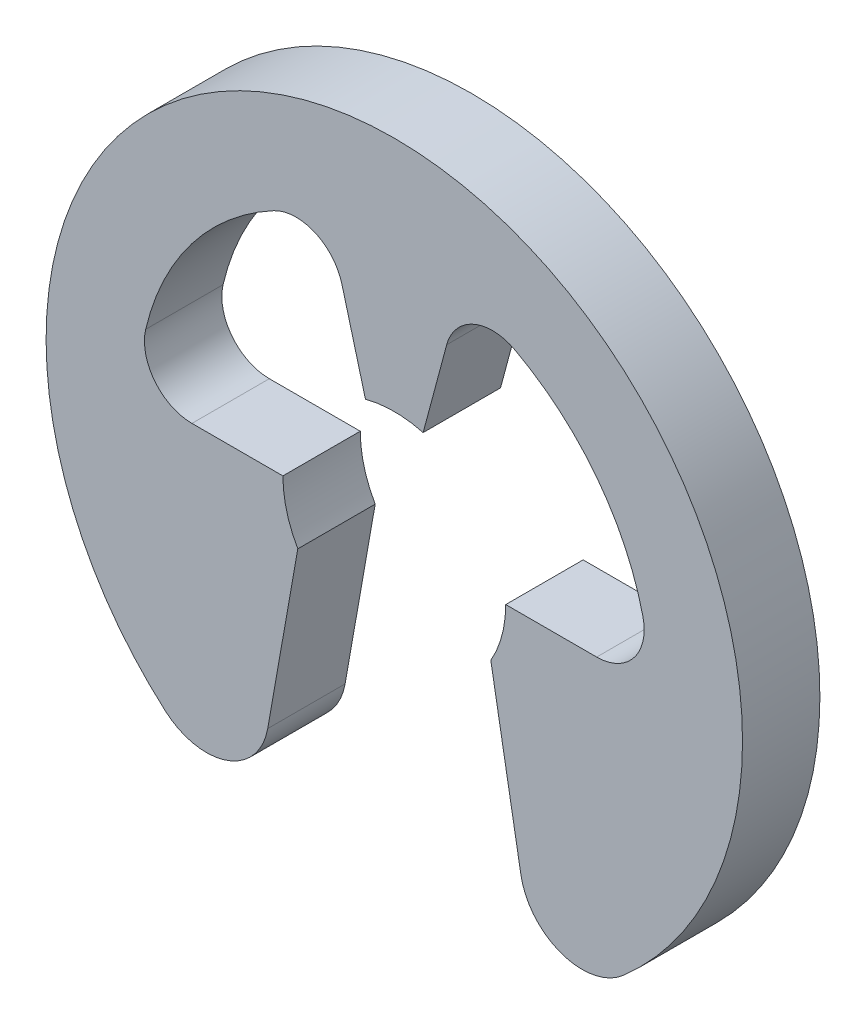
from build123d import *

# Parameters (mm, degrees)
BODY_DEPTH = 0.25


with BuildPart() as part:
    # BodySke → Body (new body)
    with BuildSketch(Plane.XY):
        with BuildLine():
            Line((0.311769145, -0.18), (0.409027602, -0.731580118))
            ThreePointArc((0.409027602, -0.731580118), (0.539984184, -0.886185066), (0.739010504, -0.848226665))
            ThreePointArc((0.739010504, -0.848226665), (0, 1.125), (-0.739010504, -0.848226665))
            ThreePointArc((-0.739010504, -0.848226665), (-0.539984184, -0.886185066), (-0.409027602, -0.731580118))
            Line((-0.409027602, -0.731580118), (-0.311769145, -0.18))
            ThreePointArc((-0.311769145, -0.18), (-0.347733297, -0.093174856), (-0.36, 0))
            Line((-0.36, 0), (-0.653783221, 0))
            ThreePointArc((-0.653783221, 0), (-0.774048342, 0.05814416), (-0.80317349, 0.188513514))
            ThreePointArc((-0.80317349, 0.188513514), (-0.654516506, 0.502228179), (-0.389966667, 0.72701513))
            ThreePointArc((-0.389966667, 0.72701513), (-0.256501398, 0.732624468), (-0.169211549, 0.631506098))
            Line((-0.169211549, 0.631506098), (-0.093174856, 0.347733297))
            ThreePointArc((-0.093174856, 0.347733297), (0, 0.36), (0.093174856, 0.347733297))
            Line((0.093174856, 0.347733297), (0.169211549, 0.631506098))
            ThreePointArc((0.169211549, 0.631506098), (0.256501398, 0.732624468), (0.389966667, 0.72701513))
            ThreePointArc((0.389966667, 0.72701513), (0.654516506, 0.502228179), (0.80317349, 0.188513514))
            ThreePointArc((0.80317349, 0.188513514), (0.774048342, 0.05814416), (0.653783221, 0))
            Line((0.653783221, 0), (0.36, 0))
            ThreePointArc((0.36, 0), (0.347733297, -0.093174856), (0.311769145, -0.18))
        make_face()
    extrude(amount=-BODY_DEPTH)


solid = part.part
